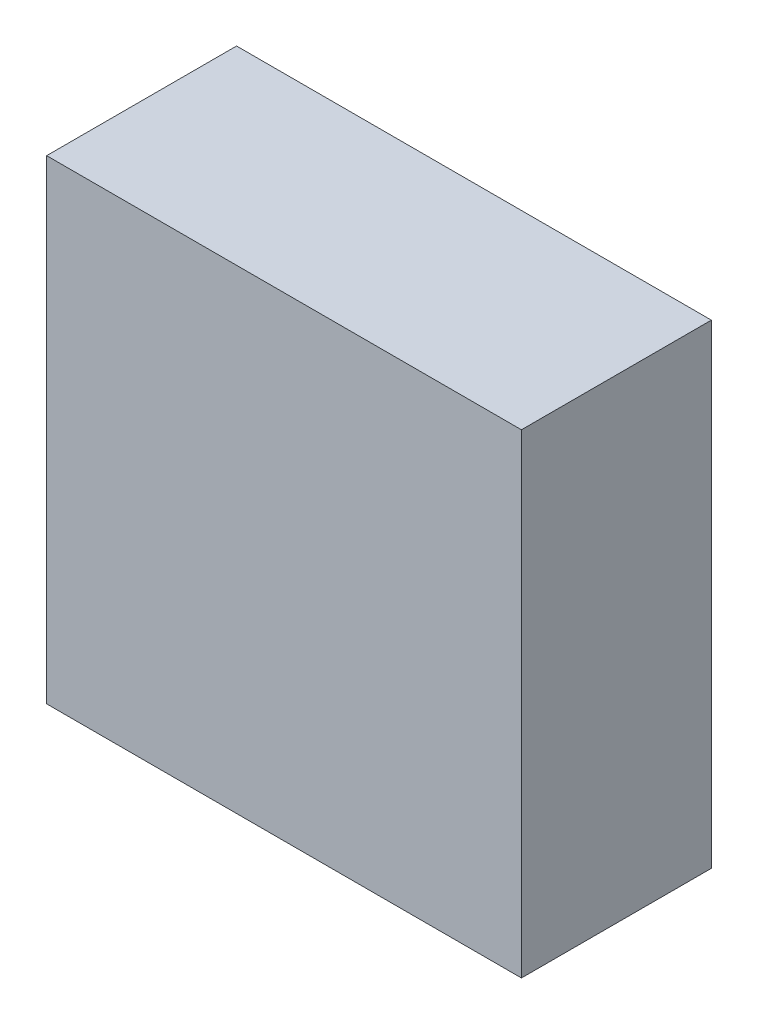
ISO-10303-21;
HEADER;
FILE_DESCRIPTION(('STEP AP214'),'2;1');
FILE_NAME('part.step','',(''),(''),'','','');
FILE_SCHEMA(('AUTOMOTIVE_DESIGN { 1 0 10303 214 1 1 1 1 }'));
ENDSEC;
DATA;
#1=APPLICATION_CONTEXT('core data for automotive mechanical design processes');
#2=APPLICATION_PROTOCOL_DEFINITION('international standard','automotive_design',2000,#1);
#3=PRODUCT_CONTEXT('',#1,'mechanical');
#4=PRODUCT('Part','Part','',(#3));
#5=PRODUCT_RELATED_PRODUCT_CATEGORY('part','',(#4));
#6=PRODUCT_DEFINITION_FORMATION('','',#4);
#7=PRODUCT_DEFINITION_CONTEXT('part definition',#1,'design');
#8=PRODUCT_DEFINITION('design','',#6,#7);
#9=PRODUCT_DEFINITION_SHAPE('','',#8);
#10=(LENGTH_UNIT() NAMED_UNIT(*) SI_UNIT(.MILLI.,.METRE.));
#11=(NAMED_UNIT(*) PLANE_ANGLE_UNIT() SI_UNIT($,.RADIAN.));
#12=(NAMED_UNIT(*) SI_UNIT($,.STERADIAN.) SOLID_ANGLE_UNIT());
#13=UNCERTAINTY_MEASURE_WITH_UNIT(LENGTH_MEASURE(1.E-05),#10,'distance_accuracy_value','');
#14=(GEOMETRIC_REPRESENTATION_CONTEXT(3) GLOBAL_UNCERTAINTY_ASSIGNED_CONTEXT((#13)) GLOBAL_UNIT_ASSIGNED_CONTEXT((#10,
#11,#12)) REPRESENTATION_CONTEXT('',''));
#15=CARTESIAN_POINT('',(0.,0.,0.));
#16=DIRECTION('',(0.,0.,1.));
#17=DIRECTION('',(1.,0.,0.));
#18=AXIS2_PLACEMENT_3D('',#15,#16,#17);
#19=CARTESIAN_POINT('',(0.,0.,10.));
#20=DIRECTION('',(1.,0.,0.));
#21=DIRECTION('',(0.,1.,0.));
#22=AXIS2_PLACEMENT_3D('',#19,#20,#21);
#23=PLANE('',#22);
#24=DIRECTION('',(0.,-1.,0.));
#25=VECTOR('',#24,1.);
#26=CARTESIAN_POINT('',(0.,0.,0.));
#27=LINE('',#26,#25);
#28=CARTESIAN_POINT('',(0.,25.,0.));
#29=VERTEX_POINT('',#28);
#30=CARTESIAN_POINT('',(0.,0.,0.));
#31=VERTEX_POINT('',#30);
#32=EDGE_CURVE('E77',#29,#31,#27,.T.);
#33=ORIENTED_EDGE('',*,*,#32,.T.);
#34=DIRECTION('',(0.,0.,-1.));
#35=VECTOR('',#34,1.);
#36=CARTESIAN_POINT('',(0.,0.,10.));
#37=LINE('',#36,#35);
#38=CARTESIAN_POINT('',(0.,0.,10.));
#39=VERTEX_POINT('',#38);
#40=EDGE_CURVE('E11',#39,#31,#37,.T.);
#41=ORIENTED_EDGE('',*,*,#40,.F.);
#42=DIRECTION('',(0.,-1.,0.));
#43=VECTOR('',#42,1.);
#44=CARTESIAN_POINT('',(0.,0.,10.));
#45=LINE('',#44,#43);
#46=CARTESIAN_POINT('',(0.,25.,10.));
#47=VERTEX_POINT('',#46);
#48=EDGE_CURVE('E95',#47,#39,#45,.T.);
#49=ORIENTED_EDGE('',*,*,#48,.F.);
#50=DIRECTION('',(0.,0.,-1.));
#51=VECTOR('',#50,1.);
#52=CARTESIAN_POINT('',(0.,25.,10.));
#53=LINE('',#52,#51);
#54=EDGE_CURVE('E89',#47,#29,#53,.T.);
#55=ORIENTED_EDGE('',*,*,#54,.T.);
#56=EDGE_LOOP('',(#33,#41,#49,#55));
#57=FACE_BOUND('',#56,.T.);
#58=ADVANCED_FACE('F33',(#57),#23,.F.);
#59=CARTESIAN_POINT('',(0.,0.,10.));
#60=DIRECTION('',(0.,1.,0.));
#61=DIRECTION('',(0.,0.,1.));
#62=AXIS2_PLACEMENT_3D('',#59,#60,#61);
#63=PLANE('',#62);
#64=DIRECTION('',(1.,0.,0.));
#65=VECTOR('',#64,1.);
#66=CARTESIAN_POINT('',(0.,0.,0.));
#67=LINE('',#66,#65);
#68=CARTESIAN_POINT('',(25.,0.,0.));
#69=VERTEX_POINT('',#68);
#70=EDGE_CURVE('E73',#31,#69,#67,.T.);
#71=ORIENTED_EDGE('',*,*,#70,.T.);
#72=DIRECTION('',(0.,0.,-1.));
#73=VECTOR('',#72,1.);
#74=CARTESIAN_POINT('',(25.,0.,10.));
#75=LINE('',#74,#73);
#76=CARTESIAN_POINT('',(25.,0.,10.));
#77=VERTEX_POINT('',#76);
#78=EDGE_CURVE('E40',#77,#69,#75,.T.);
#79=ORIENTED_EDGE('',*,*,#78,.F.);
#80=DIRECTION('',(1.,0.,0.));
#81=VECTOR('',#80,1.);
#82=CARTESIAN_POINT('',(0.,0.,10.));
#83=LINE('',#82,#81);
#84=EDGE_CURVE('E85',#39,#77,#83,.T.);
#85=ORIENTED_EDGE('',*,*,#84,.F.);
#86=ORIENTED_EDGE('',*,*,#40,.T.);
#87=EDGE_LOOP('',(#71,#79,#85,#86));
#88=FACE_BOUND('',#87,.T.);
#89=ADVANCED_FACE('F84',(#88),#63,.F.);
#90=CARTESIAN_POINT('',(25.,0.,10.));
#91=DIRECTION('',(-1.,0.,0.));
#92=DIRECTION('',(0.,0.,1.));
#93=AXIS2_PLACEMENT_3D('',#90,#91,#92);
#94=PLANE('',#93);
#95=DIRECTION('',(0.,1.,0.));
#96=VECTOR('',#95,1.);
#97=CARTESIAN_POINT('',(25.,0.,0.));
#98=LINE('',#97,#96);
#99=CARTESIAN_POINT('',(25.,25.,0.));
#100=VERTEX_POINT('',#99);
#101=EDGE_CURVE('E78',#69,#100,#98,.T.);
#102=ORIENTED_EDGE('',*,*,#101,.T.);
#103=DIRECTION('',(0.,0.,-1.));
#104=VECTOR('',#103,1.);
#105=CARTESIAN_POINT('',(25.,25.,10.));
#106=LINE('',#105,#104);
#107=CARTESIAN_POINT('',(25.,25.,10.));
#108=VERTEX_POINT('',#107);
#109=EDGE_CURVE('E101',#108,#100,#106,.T.);
#110=ORIENTED_EDGE('',*,*,#109,.F.);
#111=DIRECTION('',(0.,1.,0.));
#112=VECTOR('',#111,1.);
#113=CARTESIAN_POINT('',(25.,0.,10.));
#114=LINE('',#113,#112);
#115=EDGE_CURVE('E52',#77,#108,#114,.T.);
#116=ORIENTED_EDGE('',*,*,#115,.F.);
#117=ORIENTED_EDGE('',*,*,#78,.T.);
#118=EDGE_LOOP('',(#102,#110,#116,#117));
#119=FACE_BOUND('',#118,.T.);
#120=ADVANCED_FACE('F104',(#119),#94,.F.);
#121=CARTESIAN_POINT('',(0.,25.,10.));
#122=DIRECTION('',(0.,-1.,0.));
#123=DIRECTION('',(0.,0.,-1.));
#124=AXIS2_PLACEMENT_3D('',#121,#122,#123);
#125=PLANE('',#124);
#126=DIRECTION('',(-1.,0.,0.));
#127=VECTOR('',#126,1.);
#128=CARTESIAN_POINT('',(0.,25.,0.));
#129=LINE('',#128,#127);
#130=EDGE_CURVE('E93',#100,#29,#129,.T.);
#131=ORIENTED_EDGE('',*,*,#130,.T.);
#132=ORIENTED_EDGE('',*,*,#54,.F.);
#133=DIRECTION('',(-1.,0.,0.));
#134=VECTOR('',#133,1.);
#135=CARTESIAN_POINT('',(0.,25.,10.));
#136=LINE('',#135,#134);
#137=EDGE_CURVE('E47',#108,#47,#136,.T.);
#138=ORIENTED_EDGE('',*,*,#137,.F.);
#139=ORIENTED_EDGE('',*,*,#109,.T.);
#140=EDGE_LOOP('',(#131,#132,#138,#139));
#141=FACE_BOUND('',#140,.T.);
#142=ADVANCED_FACE('F106',(#141),#125,.F.);
#143=CARTESIAN_POINT('',(0.,25.,10.));
#144=DIRECTION('',(0.,0.,-1.));
#145=DIRECTION('',(-1.,0.,0.));
#146=AXIS2_PLACEMENT_3D('',#143,#144,#145);
#147=PLANE('',#146);
#148=ORIENTED_EDGE('',*,*,#48,.T.);
#149=ORIENTED_EDGE('',*,*,#84,.T.);
#150=ORIENTED_EDGE('',*,*,#115,.T.);
#151=ORIENTED_EDGE('',*,*,#137,.T.);
#152=EDGE_LOOP('',(#148,#149,#150,#151));
#153=FACE_BOUND('',#152,.T.);
#154=ADVANCED_FACE('F107',(#153),#147,.F.);
#155=CARTESIAN_POINT('',(0.,25.,0.));
#156=DIRECTION('',(0.,0.,-1.));
#157=DIRECTION('',(-1.,0.,0.));
#158=AXIS2_PLACEMENT_3D('',#155,#156,#157);
#159=PLANE('',#158);
#160=ORIENTED_EDGE('',*,*,#32,.F.);
#161=ORIENTED_EDGE('',*,*,#130,.F.);
#162=ORIENTED_EDGE('',*,*,#101,.F.);
#163=ORIENTED_EDGE('',*,*,#70,.F.);
#164=EDGE_LOOP('',(#160,#161,#162,#163));
#165=FACE_BOUND('',#164,.T.);
#166=ADVANCED_FACE('F74',(#165),#159,.T.);
#167=CLOSED_SHELL('',(#58,#89,#120,#142,#154,#166));
#168=MANIFOLD_SOLID_BREP('B2',#167);
#169=ADVANCED_BREP_SHAPE_REPRESENTATION('',(#18,#168),#14);
#170=SHAPE_DEFINITION_REPRESENTATION(#9,#169);
ENDSEC;
END-ISO-10303-21;
